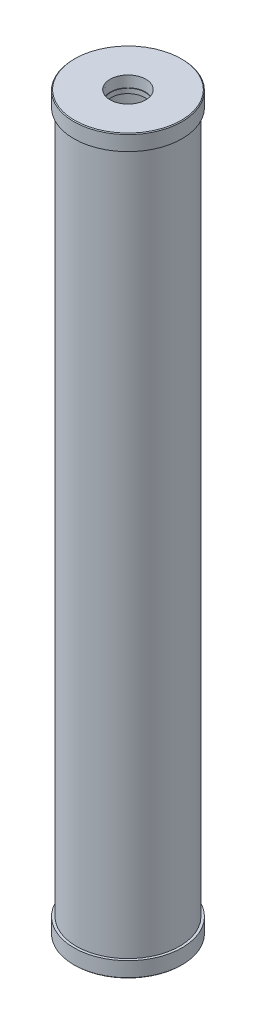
ISO-10303-21;
HEADER;
FILE_DESCRIPTION(('STEP AP214'),'2;1');
FILE_NAME('part.step','',(''),(''),'','','');
FILE_SCHEMA(('AUTOMOTIVE_DESIGN { 1 0 10303 214 1 1 1 1 }'));
ENDSEC;
DATA;
#1=APPLICATION_CONTEXT('core data for automotive mechanical design processes');
#2=APPLICATION_PROTOCOL_DEFINITION('international standard','automotive_design',2000,#1);
#3=PRODUCT_CONTEXT('',#1,'mechanical');
#4=PRODUCT('Part','Part','',(#3));
#5=PRODUCT_RELATED_PRODUCT_CATEGORY('part','',(#4));
#6=PRODUCT_DEFINITION_FORMATION('','',#4);
#7=PRODUCT_DEFINITION_CONTEXT('part definition',#1,'design');
#8=PRODUCT_DEFINITION('design','',#6,#7);
#9=PRODUCT_DEFINITION_SHAPE('','',#8);
#10=(LENGTH_UNIT() NAMED_UNIT(*) SI_UNIT(.MILLI.,.METRE.));
#11=(NAMED_UNIT(*) PLANE_ANGLE_UNIT() SI_UNIT($,.RADIAN.));
#12=(NAMED_UNIT(*) SI_UNIT($,.STERADIAN.) SOLID_ANGLE_UNIT());
#13=UNCERTAINTY_MEASURE_WITH_UNIT(LENGTH_MEASURE(1.E-05),#10,'distance_accuracy_value','');
#14=(GEOMETRIC_REPRESENTATION_CONTEXT(3) GLOBAL_UNCERTAINTY_ASSIGNED_CONTEXT((#13)) GLOBAL_UNIT_ASSIGNED_CONTEXT((#10,
#11,#12)) REPRESENTATION_CONTEXT('',''));
#15=CARTESIAN_POINT('',(0.,0.,0.));
#16=DIRECTION('',(0.,0.,1.));
#17=DIRECTION('',(1.,0.,0.));
#18=AXIS2_PLACEMENT_3D('',#15,#16,#17);
#19=CARTESIAN_POINT('',(0.,25.4,0.));
#20=DIRECTION('',(0.,1.,0.));
#21=DIRECTION('',(0.,0.,1.));
#22=AXIS2_PLACEMENT_3D('',#19,#20,#21);
#23=PLANE('',#22);
#24=CARTESIAN_POINT('',(0.,25.4,0.));
#25=DIRECTION('',(0.,1.,0.));
#26=DIRECTION('',(0.,0.,1.));
#27=AXIS2_PLACEMENT_3D('',#24,#25,#26);
#28=CIRCLE('',#27,27.7876);
#29=CARTESIAN_POINT('',(0.,25.4,27.7876));
#30=VERTEX_POINT('',#29);
#31=EDGE_CURVE('E54',#30,#30,#28,.T.);
#32=ORIENTED_EDGE('',*,*,#31,.F.);
#33=EDGE_LOOP('',(#32));
#34=FACE_BOUND('',#33,.T.);
#35=CARTESIAN_POINT('',(0.,25.4000000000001,0.));
#36=DIRECTION('',(0.,1.,0.));
#37=DIRECTION('',(0.,0.,1.));
#38=AXIS2_PLACEMENT_3D('',#35,#36,#37);
#39=CIRCLE('',#38,74.676);
#40=CARTESIAN_POINT('',(0.,25.4000000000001,74.676));
#41=VERTEX_POINT('',#40);
#42=EDGE_CURVE('E68',#41,#41,#39,.T.);
#43=ORIENTED_EDGE('',*,*,#42,.T.);
#44=EDGE_LOOP('',(#43));
#45=FACE_BOUND('',#44,.T.);
#46=ADVANCED_FACE('F33',(#34,#45),#23,.T.);
#47=CARTESIAN_POINT('',(0.,1193.8,0.));
#48=DIRECTION('',(0.,-1.,0.));
#49=DIRECTION('',(0.,0.,-1.));
#50=AXIS2_PLACEMENT_3D('',#47,#48,#49);
#51=CYLINDRICAL_SURFACE('',#50,74.676);
#52=ORIENTED_EDGE('',*,*,#42,.F.);
#53=EDGE_LOOP('',(#52));
#54=FACE_BOUND('',#53,.T.);
#55=CARTESIAN_POINT('',(0.,1168.4,0.));
#56=DIRECTION('',(0.,1.,0.));
#57=DIRECTION('',(0.,0.,1.));
#58=AXIS2_PLACEMENT_3D('',#55,#56,#57);
#59=CIRCLE('',#58,74.676);
#60=CARTESIAN_POINT('',(0.,1168.4,74.676));
#61=VERTEX_POINT('',#60);
#62=EDGE_CURVE('E64',#61,#61,#59,.T.);
#63=ORIENTED_EDGE('',*,*,#62,.T.);
#64=EDGE_LOOP('',(#63));
#65=FACE_BOUND('',#64,.T.);
#66=ADVANCED_FACE('F118',(#54,#65),#51,.F.);
#67=CARTESIAN_POINT('',(0.,1168.4,0.));
#68=DIRECTION('',(0.,1.,0.));
#69=DIRECTION('',(0.,0.,1.));
#70=AXIS2_PLACEMENT_3D('',#67,#68,#69);
#71=PLANE('',#70);
#72=CARTESIAN_POINT('',(0.,1168.4,0.));
#73=DIRECTION('',(0.,1.,0.));
#74=DIRECTION('',(0.,0.,1.));
#75=AXIS2_PLACEMENT_3D('',#72,#73,#74);
#76=CIRCLE('',#75,27.7876);
#77=CARTESIAN_POINT('',(0.,1168.4,27.7876));
#78=VERTEX_POINT('',#77);
#79=EDGE_CURVE('E59',#78,#78,#76,.T.);
#80=ORIENTED_EDGE('',*,*,#79,.T.);
#81=EDGE_LOOP('',(#80));
#82=FACE_BOUND('',#81,.T.);
#83=ORIENTED_EDGE('',*,*,#62,.F.);
#84=EDGE_LOOP('',(#83));
#85=FACE_BOUND('',#84,.T.);
#86=ADVANCED_FACE('F111',(#82,#85),#71,.F.);
#87=CARTESIAN_POINT('',(0.,1193.8,0.));
#88=DIRECTION('',(0.,1.,0.));
#89=DIRECTION('',(0.,0.,1.));
#90=AXIS2_PLACEMENT_3D('',#87,#88,#89);
#91=CYLINDRICAL_SURFACE('',#90,27.7876);
#92=CARTESIAN_POINT('',(0.,1176.02,0.));
#93=DIRECTION('',(0.,1.,0.));
#94=DIRECTION('',(0.,0.,1.));
#95=AXIS2_PLACEMENT_3D('',#92,#93,#94);
#96=CIRCLE('',#95,27.7876);
#97=CARTESIAN_POINT('',(0.,1176.02,27.7876));
#98=VERTEX_POINT('',#97);
#99=EDGE_CURVE('E63',#98,#98,#96,.T.);
#100=ORIENTED_EDGE('',*,*,#99,.T.);
#101=EDGE_LOOP('',(#100));
#102=FACE_BOUND('',#101,.T.);
#103=ORIENTED_EDGE('',*,*,#79,.F.);
#104=EDGE_LOOP('',(#103));
#105=FACE_BOUND('',#104,.T.);
#106=ADVANCED_FACE('F178',(#102,#105),#91,.F.);
#107=CARTESIAN_POINT('',(27.7876,1176.02,0.));
#108=DIRECTION('',(0.,-1.,0.));
#109=DIRECTION('',(0.,0.,-1.));
#110=AXIS2_PLACEMENT_3D('',#107,#108,#109);
#111=PLANE('',#110);
#112=ORIENTED_EDGE('',*,*,#99,.F.);
#113=EDGE_LOOP('',(#112));
#114=FACE_BOUND('',#113,.T.);
#115=CARTESIAN_POINT('',(0.,1176.02,0.));
#116=DIRECTION('',(0.,1.,0.));
#117=DIRECTION('',(0.,0.,1.));
#118=AXIS2_PLACEMENT_3D('',#115,#116,#117);
#119=CIRCLE('',#118,28.6326341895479);
#120=CARTESIAN_POINT('',(0.,1176.02,28.6326341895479));
#121=VERTEX_POINT('',#120);
#122=EDGE_CURVE('E82',#121,#121,#119,.T.);
#123=ORIENTED_EDGE('',*,*,#122,.T.);
#124=EDGE_LOOP('',(#123));
#125=FACE_BOUND('',#124,.T.);
#126=ADVANCED_FACE('F147',(#114,#125),#111,.F.);
#127=CARTESIAN_POINT('',(0.,1193.8,0.));
#128=DIRECTION('',(0.,1.,0.));
#129=DIRECTION('',(0.,0.,1.));
#130=AXIS2_PLACEMENT_3D('',#127,#128,#129);
#131=CONICAL_SURFACE('',#130,29.1649912,0.0299323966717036);
#132=ORIENTED_EDGE('',*,*,#122,.F.);
#133=EDGE_LOOP('',(#132));
#134=FACE_BOUND('',#133,.T.);
#135=CARTESIAN_POINT('',(0.,1193.8,0.));
#136=DIRECTION('',(0.,1.,0.));
#137=DIRECTION('',(0.,0.,1.));
#138=AXIS2_PLACEMENT_3D('',#135,#136,#137);
#139=CIRCLE('',#138,29.1649912);
#140=CARTESIAN_POINT('',(0.,1193.8,29.1649912));
#141=VERTEX_POINT('',#140);
#142=EDGE_CURVE('E57',#141,#141,#139,.T.);
#143=ORIENTED_EDGE('',*,*,#142,.T.);
#144=EDGE_LOOP('',(#143));
#145=FACE_BOUND('',#144,.T.);
#146=ADVANCED_FACE('F135',(#134,#145),#131,.F.);
#147=CARTESIAN_POINT('',(0.,1193.8,0.));
#148=DIRECTION('',(0.,-1.,0.));
#149=DIRECTION('',(0.,0.,-1.));
#150=AXIS2_PLACEMENT_3D('',#147,#148,#149);
#151=CYLINDRICAL_SURFACE('',#150,84.201);
#152=CARTESIAN_POINT('',(0.,25.4000000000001,0.));
#153=DIRECTION('',(0.,1.,0.));
#154=DIRECTION('',(0.,0.,1.));
#155=AXIS2_PLACEMENT_3D('',#152,#153,#154);
#156=CIRCLE('',#155,84.201);
#157=CARTESIAN_POINT('',(0.,25.4000000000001,84.201));
#158=VERTEX_POINT('',#157);
#159=EDGE_CURVE('E71',#158,#158,#156,.T.);
#160=ORIENTED_EDGE('',*,*,#159,.T.);
#161=EDGE_LOOP('',(#160));
#162=FACE_BOUND('',#161,.T.);
#163=CARTESIAN_POINT('',(0.,1168.4,0.));
#164=DIRECTION('',(0.,1.,0.));
#165=DIRECTION('',(0.,0.,1.));
#166=AXIS2_PLACEMENT_3D('',#163,#164,#165);
#167=CIRCLE('',#166,84.201);
#168=CARTESIAN_POINT('',(0.,1168.4,84.201));
#169=VERTEX_POINT('',#168);
#170=EDGE_CURVE('E53',#169,#169,#167,.T.);
#171=ORIENTED_EDGE('',*,*,#170,.F.);
#172=EDGE_LOOP('',(#171));
#173=FACE_BOUND('',#172,.T.);
#174=ADVANCED_FACE('F130',(#162,#173),#151,.T.);
#175=CARTESIAN_POINT('',(0.,25.4,0.));
#176=DIRECTION('',(0.,1.,0.));
#177=DIRECTION('',(0.,0.,1.));
#178=AXIS2_PLACEMENT_3D('',#175,#176,#177);
#179=CIRCLE('',#178,88.265);
#180=CARTESIAN_POINT('',(0.,25.4,88.265));
#181=VERTEX_POINT('',#180);
#182=EDGE_CURVE('E67',#181,#181,#179,.T.);
#183=ORIENTED_EDGE('',*,*,#182,.T.);
#184=EDGE_LOOP('',(#183));
#185=FACE_BOUND('',#184,.T.);
#186=ORIENTED_EDGE('',*,*,#159,.F.);
#187=EDGE_LOOP('',(#186));
#188=FACE_BOUND('',#187,.T.);
#189=ADVANCED_FACE('F112',(#185,#188),#23,.T.);
#190=CARTESIAN_POINT('',(0.,25.4,0.));
#191=DIRECTION('',(0.,-1.,0.));
#192=DIRECTION('',(0.,0.,-1.));
#193=AXIS2_PLACEMENT_3D('',#190,#191,#192);
#194=CYLINDRICAL_SURFACE('',#193,88.265);
#195=CARTESIAN_POINT('',(0.,1.27000000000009,0.));
#196=DIRECTION('',(0.,1.,0.));
#197=DIRECTION('',(0.,0.,1.));
#198=AXIS2_PLACEMENT_3D('',#195,#196,#197);
#199=CIRCLE('',#198,88.265);
#200=CARTESIAN_POINT('',(0.,1.27000000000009,88.265));
#201=VERTEX_POINT('',#200);
#202=EDGE_CURVE('E48',#201,#201,#199,.T.);
#203=ORIENTED_EDGE('',*,*,#202,.T.);
#204=EDGE_LOOP('',(#203));
#205=FACE_BOUND('',#204,.T.);
#206=ORIENTED_EDGE('',*,*,#182,.F.);
#207=EDGE_LOOP('',(#206));
#208=FACE_BOUND('',#207,.T.);
#209=ADVANCED_FACE('F101',(#205,#208),#194,.T.);
#210=CARTESIAN_POINT('',(0.,0.,0.));
#211=DIRECTION('',(0.,1.,0.));
#212=DIRECTION('',(0.,0.,1.));
#213=AXIS2_PLACEMENT_3D('',#210,#211,#212);
#214=PLANE('',#213);
#215=CARTESIAN_POINT('',(0.,0.,0.));
#216=DIRECTION('',(0.,1.,0.));
#217=DIRECTION('',(0.,0.,1.));
#218=AXIS2_PLACEMENT_3D('',#215,#216,#217);
#219=CIRCLE('',#218,86.9949999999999);
#220=CARTESIAN_POINT('',(0.,0.,86.9949999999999));
#221=VERTEX_POINT('',#220);
#222=EDGE_CURVE('E44',#221,#221,#219,.F.);
#223=ORIENTED_EDGE('',*,*,#222,.T.);
#224=EDGE_LOOP('',(#223));
#225=FACE_BOUND('',#224,.T.);
#226=CARTESIAN_POINT('',(0.,0.,0.));
#227=DIRECTION('',(0.,-1.,0.));
#228=DIRECTION('',(0.,0.,-1.));
#229=AXIS2_PLACEMENT_3D('',#226,#227,#228);
#230=CIRCLE('',#229,29.1649912);
#231=CARTESIAN_POINT('',(0.,0.,-29.1649912));
#232=VERTEX_POINT('',#231);
#233=EDGE_CURVE('E92',#232,#232,#230,.T.);
#234=ORIENTED_EDGE('',*,*,#233,.F.);
#235=EDGE_LOOP('',(#234));
#236=FACE_BOUND('',#235,.T.);
#237=ADVANCED_FACE('F98',(#225,#236),#214,.F.);
#238=CARTESIAN_POINT('',(0.,1168.4,0.));
#239=DIRECTION('',(0.,1.,0.));
#240=DIRECTION('',(0.,0.,1.));
#241=AXIS2_PLACEMENT_3D('',#238,#239,#240);
#242=CIRCLE('',#241,88.265);
#243=CARTESIAN_POINT('',(0.,1168.4,88.265));
#244=VERTEX_POINT('',#243);
#245=EDGE_CURVE('E62',#244,#244,#242,.T.);
#246=ORIENTED_EDGE('',*,*,#245,.F.);
#247=EDGE_LOOP('',(#246));
#248=FACE_BOUND('',#247,.T.);
#249=ORIENTED_EDGE('',*,*,#170,.T.);
#250=EDGE_LOOP('',(#249));
#251=FACE_BOUND('',#250,.T.);
#252=ADVANCED_FACE('F100',(#248,#251),#71,.F.);
#253=CARTESIAN_POINT('',(0.,1168.4,0.));
#254=DIRECTION('',(0.,1.,0.));
#255=DIRECTION('',(0.,0.,1.));
#256=AXIS2_PLACEMENT_3D('',#253,#254,#255);
#257=CYLINDRICAL_SURFACE('',#256,88.265);
#258=CARTESIAN_POINT('',(0.,1192.53,0.));
#259=DIRECTION('',(0.,1.,0.));
#260=DIRECTION('',(0.,0.,1.));
#261=AXIS2_PLACEMENT_3D('',#258,#259,#260);
#262=CIRCLE('',#261,88.265);
#263=CARTESIAN_POINT('',(0.,1192.53,88.265));
#264=VERTEX_POINT('',#263);
#265=EDGE_CURVE('E10',#264,#264,#262,.F.);
#266=ORIENTED_EDGE('',*,*,#265,.T.);
#267=EDGE_LOOP('',(#266));
#268=FACE_BOUND('',#267,.T.);
#269=ORIENTED_EDGE('',*,*,#245,.T.);
#270=EDGE_LOOP('',(#269));
#271=FACE_BOUND('',#270,.T.);
#272=ADVANCED_FACE('F108',(#268,#271),#257,.T.);
#273=CARTESIAN_POINT('',(0.,1193.8,0.));
#274=DIRECTION('',(0.,1.,0.));
#275=DIRECTION('',(0.,0.,1.));
#276=AXIS2_PLACEMENT_3D('',#273,#274,#275);
#277=PLANE('',#276);
#278=CARTESIAN_POINT('',(0.,1193.8,0.));
#279=DIRECTION('',(0.,1.,0.));
#280=DIRECTION('',(0.,0.,1.));
#281=AXIS2_PLACEMENT_3D('',#278,#279,#280);
#282=CIRCLE('',#281,86.995);
#283=CARTESIAN_POINT('',(0.,1193.8,86.995));
#284=VERTEX_POINT('',#283);
#285=EDGE_CURVE('E40',#284,#284,#282,.T.);
#286=ORIENTED_EDGE('',*,*,#285,.T.);
#287=EDGE_LOOP('',(#286));
#288=FACE_BOUND('',#287,.T.);
#289=ORIENTED_EDGE('',*,*,#142,.F.);
#290=EDGE_LOOP('',(#289));
#291=FACE_BOUND('',#290,.T.);
#292=ADVANCED_FACE('F173',(#288,#291),#277,.T.);
#293=CARTESIAN_POINT('',(0.,0.,0.));
#294=DIRECTION('',(0.,-1.,0.));
#295=DIRECTION('',(0.,0.,-1.));
#296=AXIS2_PLACEMENT_3D('',#293,#294,#295);
#297=CYLINDRICAL_SURFACE('',#296,27.7876);
#298=ORIENTED_EDGE('',*,*,#31,.T.);
#299=EDGE_LOOP('',(#298));
#300=FACE_BOUND('',#299,.T.);
#301=CARTESIAN_POINT('',(0.,17.78,0.));
#302=DIRECTION('',(0.,-1.,0.));
#303=DIRECTION('',(0.,0.,-1.));
#304=AXIS2_PLACEMENT_3D('',#301,#302,#303);
#305=CIRCLE('',#304,27.7876);
#306=CARTESIAN_POINT('',(0.,17.78,-27.7876));
#307=VERTEX_POINT('',#306);
#308=EDGE_CURVE('E58',#307,#307,#305,.T.);
#309=ORIENTED_EDGE('',*,*,#308,.T.);
#310=EDGE_LOOP('',(#309));
#311=FACE_BOUND('',#310,.T.);
#312=ADVANCED_FACE('F167',(#300,#311),#297,.F.);
#313=CARTESIAN_POINT('',(27.7876,17.78,0.));
#314=DIRECTION('',(0.,1.,0.));
#315=DIRECTION('',(0.,0.,1.));
#316=AXIS2_PLACEMENT_3D('',#313,#314,#315);
#317=PLANE('',#316);
#318=ORIENTED_EDGE('',*,*,#308,.F.);
#319=EDGE_LOOP('',(#318));
#320=FACE_BOUND('',#319,.T.);
#321=CARTESIAN_POINT('',(0.,17.78,0.));
#322=DIRECTION('',(0.,-1.,0.));
#323=DIRECTION('',(0.,0.,-1.));
#324=AXIS2_PLACEMENT_3D('',#321,#322,#323);
#325=CIRCLE('',#324,28.6326341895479);
#326=CARTESIAN_POINT('',(0.,17.78,-28.6326341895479));
#327=VERTEX_POINT('',#326);
#328=EDGE_CURVE('E89',#327,#327,#325,.T.);
#329=ORIENTED_EDGE('',*,*,#328,.T.);
#330=EDGE_LOOP('',(#329));
#331=FACE_BOUND('',#330,.T.);
#332=ADVANCED_FACE('F158',(#320,#331),#317,.F.);
#333=CARTESIAN_POINT('',(0.,0.,0.));
#334=DIRECTION('',(0.,-1.,0.));
#335=DIRECTION('',(0.,0.,-1.));
#336=AXIS2_PLACEMENT_3D('',#333,#334,#335);
#337=CONICAL_SURFACE('',#336,29.1649912,0.0299323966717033);
#338=ORIENTED_EDGE('',*,*,#328,.F.);
#339=EDGE_LOOP('',(#338));
#340=FACE_BOUND('',#339,.T.);
#341=ORIENTED_EDGE('',*,*,#233,.T.);
#342=EDGE_LOOP('',(#341));
#343=FACE_BOUND('',#342,.T.);
#344=ADVANCED_FACE('F96',(#340,#343),#337,.F.);
#345=CARTESIAN_POINT('',(0.,1.27000000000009,0.));
#346=DIRECTION('',(0.,1.,0.));
#347=DIRECTION('',(0.,0.,1.));
#348=AXIS2_PLACEMENT_3D('',#345,#346,#347);
#349=CONICAL_SURFACE('',#348,88.265,0.785398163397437);
#350=ORIENTED_EDGE('',*,*,#222,.F.);
#351=EDGE_LOOP('',(#350));
#352=FACE_BOUND('',#351,.T.);
#353=ORIENTED_EDGE('',*,*,#202,.F.);
#354=EDGE_LOOP('',(#353));
#355=FACE_BOUND('',#354,.T.);
#356=ADVANCED_FACE('F150',(#352,#355),#349,.T.);
#357=CARTESIAN_POINT('',(0.,1193.8,0.));
#358=DIRECTION('',(0.,-1.,0.));
#359=DIRECTION('',(0.,0.,-1.));
#360=AXIS2_PLACEMENT_3D('',#357,#358,#359);
#361=CONICAL_SURFACE('',#360,86.995,0.785398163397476);
#362=ORIENTED_EDGE('',*,*,#265,.F.);
#363=EDGE_LOOP('',(#362));
#364=FACE_BOUND('',#363,.T.);
#365=ORIENTED_EDGE('',*,*,#285,.F.);
#366=EDGE_LOOP('',(#365));
#367=FACE_BOUND('',#366,.T.);
#368=ADVANCED_FACE('F35',(#364,#367),#361,.T.);
#369=CLOSED_SHELL('',(#46,#66,#86,#106,#126,#146,#174,#189,#209,#237,#252,#272,#292,#312,#332,
#344,#356,#368));
#370=MANIFOLD_SOLID_BREP('B2',#369);
#371=ADVANCED_BREP_SHAPE_REPRESENTATION('',(#18,#370),#14);
#372=SHAPE_DEFINITION_REPRESENTATION(#9,#371);
ENDSEC;
END-ISO-10303-21;
